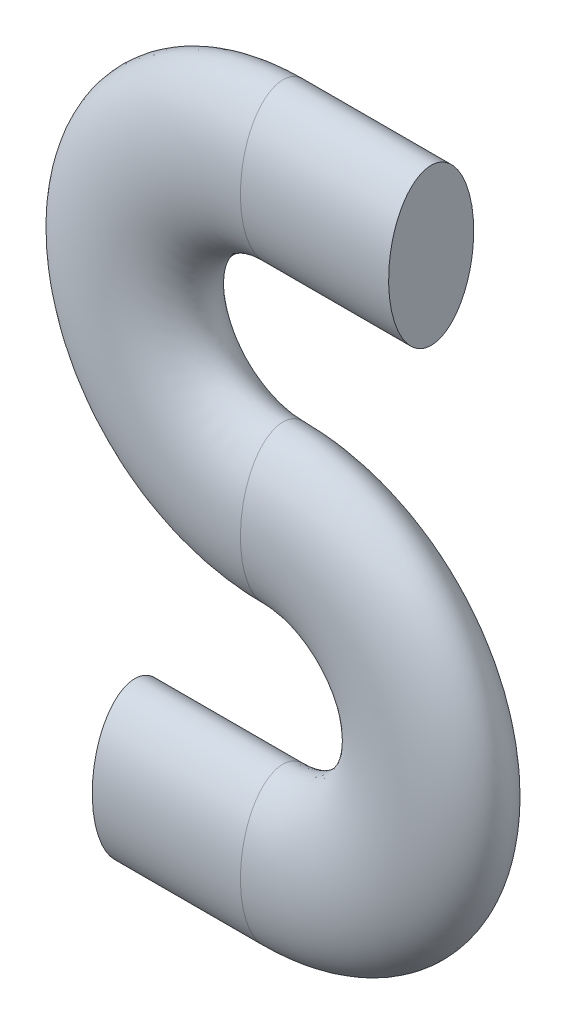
from build123d import *

# Parameters (mm, degrees)
SKETCH2_RX = 7.33056886
SKETCH2_RY = 4


with BuildPart() as part:
    # Base-Sweep: sweep along a path in Sketch1
    with BuildLine(Plane.XY) as base_sweep_path:
        Line((0, 0), (13.928880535, 0))
        ThreePointArc((13.928880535, 0), (27.85776107, 13.928880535), (13.928880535, 27.85776107))
        ThreePointArc((13.928880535, 27.85776107), (0, 41.786641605), (13.928880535, 55.71552214))
        Line((13.928880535, 55.71552214), (27.85776107, 55.71552214))
    # Sketch2 → Base-Sweep (sweep)
    with BuildSketch(Plane(origin=(0, 0, 0), x_dir=(0, 0, -1), z_dir=(1, 0, 0))):
        with Locations(Location((0, 0), (0, 0, 90))):
            Ellipse(SKETCH2_RX, SKETCH2_RY)
    sweep(path=base_sweep_path.line)


solid = part.part
